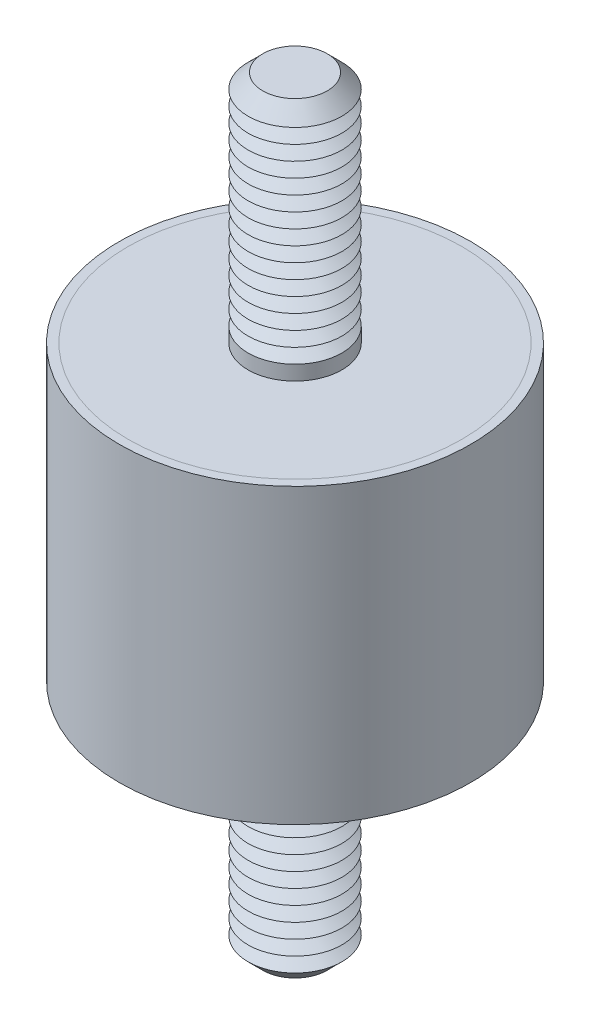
ISO-10303-21;
HEADER;
FILE_DESCRIPTION(('STEP AP214'),'2;1');
FILE_NAME('part.step','',(''),(''),'','','');
FILE_SCHEMA(('AUTOMOTIVE_DESIGN { 1 0 10303 214 1 1 1 1 }'));
ENDSEC;
DATA;
#1=APPLICATION_CONTEXT('core data for automotive mechanical design processes');
#2=APPLICATION_PROTOCOL_DEFINITION('international standard','automotive_design',2000,#1);
#3=PRODUCT_CONTEXT('',#1,'mechanical');
#4=PRODUCT('Part','Part','',(#3));
#5=PRODUCT_RELATED_PRODUCT_CATEGORY('part','',(#4));
#6=PRODUCT_DEFINITION_FORMATION('','',#4);
#7=PRODUCT_DEFINITION_CONTEXT('part definition',#1,'design');
#8=PRODUCT_DEFINITION('design','',#6,#7);
#9=PRODUCT_DEFINITION_SHAPE('','',#8);
#10=(LENGTH_UNIT() NAMED_UNIT(*) SI_UNIT(.MILLI.,.METRE.));
#11=(NAMED_UNIT(*) PLANE_ANGLE_UNIT() SI_UNIT($,.RADIAN.));
#12=(NAMED_UNIT(*) SI_UNIT($,.STERADIAN.) SOLID_ANGLE_UNIT());
#13=UNCERTAINTY_MEASURE_WITH_UNIT(LENGTH_MEASURE(1.E-05),#10,'distance_accuracy_value','');
#14=(GEOMETRIC_REPRESENTATION_CONTEXT(3) GLOBAL_UNCERTAINTY_ASSIGNED_CONTEXT((#13)) GLOBAL_UNIT_ASSIGNED_CONTEXT((#10,
#11,#12)) REPRESENTATION_CONTEXT('',''));
#15=CARTESIAN_POINT('',(0.,0.,0.));
#16=DIRECTION('',(0.,0.,1.));
#17=DIRECTION('',(1.,0.,0.));
#18=AXIS2_PLACEMENT_3D('',#15,#16,#17);
#19=CARTESIAN_POINT('',(0.,-32.5,0.));
#20=DIRECTION('',(0.,1.,0.));
#21=DIRECTION('',(0.,0.,1.));
#22=AXIS2_PLACEMENT_3D('',#19,#20,#21);
#23=CYLINDRICAL_SURFACE('',#22,4.);
#24=CARTESIAN_POINT('',(0.,-12.5,0.));
#25=DIRECTION('',(0.,-1.,0.));
#26=DIRECTION('',(0.,0.,-1.));
#27=AXIS2_PLACEMENT_3D('',#24,#25,#26);
#28=CIRCLE('',#27,4.);
#29=CARTESIAN_POINT('',(0.,-12.5,-4.));
#30=VERTEX_POINT('',#29);
#31=EDGE_CURVE('P0_E21',#30,#30,#28,.T.);
#32=ORIENTED_EDGE('',*,*,#31,.T.);
#33=EDGE_LOOP('',(#32));
#34=FACE_BOUND('',#33,.T.);
#35=CARTESIAN_POINT('',(0.,-13.75,0.));
#36=DIRECTION('',(0.,1.,0.));
#37=DIRECTION('',(0.,0.,1.));
#38=AXIS2_PLACEMENT_3D('',#35,#36,#37);
#39=CIRCLE('',#38,4.);
#40=CARTESIAN_POINT('',(0.,-13.75,4.));
#41=VERTEX_POINT('',#40);
#42=EDGE_CURVE('P0_E33',#41,#41,#39,.T.);
#43=ORIENTED_EDGE('',*,*,#42,.T.);
#44=EDGE_LOOP('',(#43));
#45=FACE_BOUND('',#44,.T.);
#46=ADVANCED_FACE('P0_F14',(#34,#45),#23,.T.);
#47=CARTESIAN_POINT('',(0.,-12.5,0.));
#48=DIRECTION('',(0.,1.,0.));
#49=DIRECTION('',(0.,0.,1.));
#50=AXIS2_PLACEMENT_3D('',#47,#48,#49);
#51=CYLINDRICAL_SURFACE('',#50,14.25);
#52=CARTESIAN_POINT('',(0.,-12.5,0.));
#53=DIRECTION('',(0.,1.,0.));
#54=DIRECTION('',(0.,0.,1.));
#55=AXIS2_PLACEMENT_3D('',#52,#53,#54);
#56=CIRCLE('',#55,14.25);
#57=CARTESIAN_POINT('',(0.,-12.5,14.25));
#58=VERTEX_POINT('',#57);
#59=EDGE_CURVE('P0_E25',#58,#58,#56,.T.);
#60=ORIENTED_EDGE('',*,*,#59,.T.);
#61=EDGE_LOOP('',(#60));
#62=FACE_BOUND('',#61,.T.);
#63=CARTESIAN_POINT('',(0.,-11.5,0.));
#64=DIRECTION('',(0.,1.,0.));
#65=DIRECTION('',(0.,0.,1.));
#66=AXIS2_PLACEMENT_3D('',#63,#64,#65);
#67=CIRCLE('',#66,14.25);
#68=CARTESIAN_POINT('',(0.,-11.5,14.25));
#69=VERTEX_POINT('',#68);
#70=EDGE_CURVE('P0_E30',#69,#69,#67,.T.);
#71=ORIENTED_EDGE('',*,*,#70,.F.);
#72=EDGE_LOOP('',(#71));
#73=FACE_BOUND('',#72,.T.);
#74=ADVANCED_FACE('P0_F145',(#62,#73),#51,.T.);
#75=CARTESIAN_POINT('',(0.,-12.5,0.));
#76=DIRECTION('',(0.,1.,0.));
#77=DIRECTION('',(0.,0.,1.));
#78=AXIS2_PLACEMENT_3D('',#75,#76,#77);
#79=PLANE('',#78);
#80=ORIENTED_EDGE('',*,*,#31,.F.);
#81=EDGE_LOOP('',(#80));
#82=FACE_BOUND('',#81,.T.);
#83=ORIENTED_EDGE('',*,*,#59,.F.);
#84=EDGE_LOOP('',(#83));
#85=FACE_BOUND('',#84,.T.);
#86=ADVANCED_FACE('P0_F150',(#82,#85),#79,.F.);
#87=CARTESIAN_POINT('',(0.,-11.5,0.));
#88=DIRECTION('',(0.,1.,0.));
#89=DIRECTION('',(0.,0.,1.));
#90=AXIS2_PLACEMENT_3D('',#87,#88,#89);
#91=PLANE('',#90);
#92=ORIENTED_EDGE('',*,*,#70,.T.);
#93=EDGE_LOOP('',(#92));
#94=FACE_BOUND('',#93,.T.);
#95=ADVANCED_FACE('P0_F156',(#94),#91,.T.);
#96=CARTESIAN_POINT('',(0.,-13.75,0.));
#97=DIRECTION('',(0.,1.,0.));
#98=DIRECTION('',(0.,0.,1.));
#99=AXIS2_PLACEMENT_3D('',#96,#97,#98);
#100=CONICAL_SURFACE('',#99,4.,1.0471975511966);
#101=CARTESIAN_POINT('',(0.,-14.375,0.));
#102=DIRECTION('',(0.,1.,0.));
#103=DIRECTION('',(0.,0.,1.));
#104=AXIS2_PLACEMENT_3D('',#101,#102,#103);
#105=CIRCLE('',#104,2.91746824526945);
#106=CARTESIAN_POINT('',(0.,-14.375,2.91746824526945));
#107=VERTEX_POINT('',#106);
#108=EDGE_CURVE('P0_E39',#107,#107,#105,.T.);
#109=ORIENTED_EDGE('',*,*,#108,.T.);
#110=EDGE_LOOP('',(#109));
#111=FACE_BOUND('',#110,.T.);
#112=ORIENTED_EDGE('',*,*,#42,.F.);
#113=EDGE_LOOP('',(#112));
#114=FACE_BOUND('',#113,.T.);
#115=ADVANCED_FACE('P0_F159',(#111,#114),#100,.T.);
#116=CARTESIAN_POINT('',(0.,-14.375,0.));
#117=DIRECTION('',(0.,-1.,0.));
#118=DIRECTION('',(0.,0.,-1.));
#119=AXIS2_PLACEMENT_3D('',#116,#117,#118);
#120=CONICAL_SURFACE('',#119,2.91746824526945,1.04719755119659);
#121=CARTESIAN_POINT('',(0.,-15.,0.));
#122=DIRECTION('',(0.,1.,0.));
#123=DIRECTION('',(0.,0.,1.));
#124=AXIS2_PLACEMENT_3D('',#121,#122,#123);
#125=CIRCLE('',#124,4.);
#126=CARTESIAN_POINT('',(0.,-15.,4.));
#127=VERTEX_POINT('',#126);
#128=EDGE_CURVE('P0_E43',#127,#127,#125,.T.);
#129=ORIENTED_EDGE('',*,*,#128,.T.);
#130=EDGE_LOOP('',(#129));
#131=FACE_BOUND('',#130,.T.);
#132=ORIENTED_EDGE('',*,*,#108,.F.);
#133=EDGE_LOOP('',(#132));
#134=FACE_BOUND('',#133,.T.);
#135=ADVANCED_FACE('P0_F163',(#131,#134),#120,.T.);
#136=CARTESIAN_POINT('',(0.,-15.,0.));
#137=DIRECTION('',(0.,1.,0.));
#138=DIRECTION('',(0.,0.,1.));
#139=AXIS2_PLACEMENT_3D('',#136,#137,#138);
#140=CONICAL_SURFACE('',#139,4.,1.0471975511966);
#141=CARTESIAN_POINT('',(0.,-15.625,0.));
#142=DIRECTION('',(0.,1.,0.));
#143=DIRECTION('',(0.,0.,1.));
#144=AXIS2_PLACEMENT_3D('',#141,#142,#143);
#145=CIRCLE('',#144,2.91746824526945);
#146=CARTESIAN_POINT('',(0.,-15.625,2.91746824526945));
#147=VERTEX_POINT('',#146);
#148=EDGE_CURVE('P0_E47',#147,#147,#145,.T.);
#149=ORIENTED_EDGE('',*,*,#148,.T.);
#150=EDGE_LOOP('',(#149));
#151=FACE_BOUND('',#150,.T.);
#152=ORIENTED_EDGE('',*,*,#128,.F.);
#153=EDGE_LOOP('',(#152));
#154=FACE_BOUND('',#153,.T.);
#155=ADVANCED_FACE('P0_F167',(#151,#154),#140,.T.);
#156=CARTESIAN_POINT('',(0.,-15.625,0.));
#157=DIRECTION('',(0.,-1.,0.));
#158=DIRECTION('',(0.,0.,-1.));
#159=AXIS2_PLACEMENT_3D('',#156,#157,#158);
#160=CONICAL_SURFACE('',#159,2.91746824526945,1.04719755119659);
#161=CARTESIAN_POINT('',(0.,-16.25,0.));
#162=DIRECTION('',(0.,1.,0.));
#163=DIRECTION('',(0.,0.,1.));
#164=AXIS2_PLACEMENT_3D('',#161,#162,#163);
#165=CIRCLE('',#164,4.);
#166=CARTESIAN_POINT('',(0.,-16.25,4.));
#167=VERTEX_POINT('',#166);
#168=EDGE_CURVE('P0_E52',#167,#167,#165,.T.);
#169=ORIENTED_EDGE('',*,*,#168,.T.);
#170=EDGE_LOOP('',(#169));
#171=FACE_BOUND('',#170,.T.);
#172=ORIENTED_EDGE('',*,*,#148,.F.);
#173=EDGE_LOOP('',(#172));
#174=FACE_BOUND('',#173,.T.);
#175=ADVANCED_FACE('P0_F174',(#171,#174),#160,.T.);
#176=CARTESIAN_POINT('',(0.,-16.25,0.));
#177=DIRECTION('',(0.,1.,0.));
#178=DIRECTION('',(0.,0.,1.));
#179=AXIS2_PLACEMENT_3D('',#176,#177,#178);
#180=CONICAL_SURFACE('',#179,4.,1.0471975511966);
#181=CARTESIAN_POINT('',(0.,-16.875,0.));
#182=DIRECTION('',(0.,1.,0.));
#183=DIRECTION('',(0.,0.,1.));
#184=AXIS2_PLACEMENT_3D('',#181,#182,#183);
#185=CIRCLE('',#184,2.91746824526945);
#186=CARTESIAN_POINT('',(0.,-16.875,2.91746824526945));
#187=VERTEX_POINT('',#186);
#188=EDGE_CURVE('P0_E55',#187,#187,#185,.T.);
#189=ORIENTED_EDGE('',*,*,#188,.T.);
#190=EDGE_LOOP('',(#189));
#191=FACE_BOUND('',#190,.T.);
#192=ORIENTED_EDGE('',*,*,#168,.F.);
#193=EDGE_LOOP('',(#192));
#194=FACE_BOUND('',#193,.T.);
#195=ADVANCED_FACE('P0_F178',(#191,#194),#180,.T.);
#196=CARTESIAN_POINT('',(0.,-16.875,0.));
#197=DIRECTION('',(0.,-1.,0.));
#198=DIRECTION('',(0.,0.,-1.));
#199=AXIS2_PLACEMENT_3D('',#196,#197,#198);
#200=CONICAL_SURFACE('',#199,2.91746824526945,1.04719755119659);
#201=CARTESIAN_POINT('',(0.,-17.5,0.));
#202=DIRECTION('',(0.,1.,0.));
#203=DIRECTION('',(0.,0.,1.));
#204=AXIS2_PLACEMENT_3D('',#201,#202,#203);
#205=CIRCLE('',#204,4.);
#206=CARTESIAN_POINT('',(0.,-17.5,4.));
#207=VERTEX_POINT('',#206);
#208=EDGE_CURVE('P0_E58',#207,#207,#205,.T.);
#209=ORIENTED_EDGE('',*,*,#208,.T.);
#210=EDGE_LOOP('',(#209));
#211=FACE_BOUND('',#210,.T.);
#212=ORIENTED_EDGE('',*,*,#188,.F.);
#213=EDGE_LOOP('',(#212));
#214=FACE_BOUND('',#213,.T.);
#215=ADVANCED_FACE('P0_F182',(#211,#214),#200,.T.);
#216=CARTESIAN_POINT('',(0.,-17.5,0.));
#217=DIRECTION('',(0.,1.,0.));
#218=DIRECTION('',(0.,0.,1.));
#219=AXIS2_PLACEMENT_3D('',#216,#217,#218);
#220=CONICAL_SURFACE('',#219,4.,1.0471975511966);
#221=CARTESIAN_POINT('',(0.,-18.125,0.));
#222=DIRECTION('',(0.,1.,0.));
#223=DIRECTION('',(0.,0.,1.));
#224=AXIS2_PLACEMENT_3D('',#221,#222,#223);
#225=CIRCLE('',#224,2.91746824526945);
#226=CARTESIAN_POINT('',(0.,-18.125,2.91746824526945));
#227=VERTEX_POINT('',#226);
#228=EDGE_CURVE('P0_E61',#227,#227,#225,.T.);
#229=ORIENTED_EDGE('',*,*,#228,.T.);
#230=EDGE_LOOP('',(#229));
#231=FACE_BOUND('',#230,.T.);
#232=ORIENTED_EDGE('',*,*,#208,.F.);
#233=EDGE_LOOP('',(#232));
#234=FACE_BOUND('',#233,.T.);
#235=ADVANCED_FACE('P0_F186',(#231,#234),#220,.T.);
#236=CARTESIAN_POINT('',(0.,-18.125,0.));
#237=DIRECTION('',(0.,-1.,0.));
#238=DIRECTION('',(0.,0.,-1.));
#239=AXIS2_PLACEMENT_3D('',#236,#237,#238);
#240=CONICAL_SURFACE('',#239,2.91746824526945,1.04719755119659);
#241=CARTESIAN_POINT('',(0.,-18.75,0.));
#242=DIRECTION('',(0.,1.,0.));
#243=DIRECTION('',(0.,0.,1.));
#244=AXIS2_PLACEMENT_3D('',#241,#242,#243);
#245=CIRCLE('',#244,4.);
#246=CARTESIAN_POINT('',(0.,-18.75,4.));
#247=VERTEX_POINT('',#246);
#248=EDGE_CURVE('P0_E64',#247,#247,#245,.T.);
#249=ORIENTED_EDGE('',*,*,#248,.T.);
#250=EDGE_LOOP('',(#249));
#251=FACE_BOUND('',#250,.T.);
#252=ORIENTED_EDGE('',*,*,#228,.F.);
#253=EDGE_LOOP('',(#252));
#254=FACE_BOUND('',#253,.T.);
#255=ADVANCED_FACE('P0_F190',(#251,#254),#240,.T.);
#256=CARTESIAN_POINT('',(0.,-18.75,0.));
#257=DIRECTION('',(0.,1.,0.));
#258=DIRECTION('',(0.,0.,1.));
#259=AXIS2_PLACEMENT_3D('',#256,#257,#258);
#260=CONICAL_SURFACE('',#259,4.,1.0471975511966);
#261=CARTESIAN_POINT('',(0.,-19.375,0.));
#262=DIRECTION('',(0.,1.,0.));
#263=DIRECTION('',(0.,0.,1.));
#264=AXIS2_PLACEMENT_3D('',#261,#262,#263);
#265=CIRCLE('',#264,2.91746824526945);
#266=CARTESIAN_POINT('',(0.,-19.375,2.91746824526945));
#267=VERTEX_POINT('',#266);
#268=EDGE_CURVE('P0_E67',#267,#267,#265,.T.);
#269=ORIENTED_EDGE('',*,*,#268,.T.);
#270=EDGE_LOOP('',(#269));
#271=FACE_BOUND('',#270,.T.);
#272=ORIENTED_EDGE('',*,*,#248,.F.);
#273=EDGE_LOOP('',(#272));
#274=FACE_BOUND('',#273,.T.);
#275=ADVANCED_FACE('P0_F194',(#271,#274),#260,.T.);
#276=CARTESIAN_POINT('',(0.,-19.375,0.));
#277=DIRECTION('',(0.,-1.,0.));
#278=DIRECTION('',(0.,0.,-1.));
#279=AXIS2_PLACEMENT_3D('',#276,#277,#278);
#280=CONICAL_SURFACE('',#279,2.91746824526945,1.04719755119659);
#281=CARTESIAN_POINT('',(0.,-20.,0.));
#282=DIRECTION('',(0.,1.,0.));
#283=DIRECTION('',(0.,0.,1.));
#284=AXIS2_PLACEMENT_3D('',#281,#282,#283);
#285=CIRCLE('',#284,4.);
#286=CARTESIAN_POINT('',(0.,-20.,4.));
#287=VERTEX_POINT('',#286);
#288=EDGE_CURVE('P0_E70',#287,#287,#285,.T.);
#289=ORIENTED_EDGE('',*,*,#288,.T.);
#290=EDGE_LOOP('',(#289));
#291=FACE_BOUND('',#290,.T.);
#292=ORIENTED_EDGE('',*,*,#268,.F.);
#293=EDGE_LOOP('',(#292));
#294=FACE_BOUND('',#293,.T.);
#295=ADVANCED_FACE('P0_F198',(#291,#294),#280,.T.);
#296=CARTESIAN_POINT('',(0.,-20.,0.));
#297=DIRECTION('',(0.,1.,0.));
#298=DIRECTION('',(0.,0.,1.));
#299=AXIS2_PLACEMENT_3D('',#296,#297,#298);
#300=CONICAL_SURFACE('',#299,4.,1.0471975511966);
#301=CARTESIAN_POINT('',(0.,-20.625,0.));
#302=DIRECTION('',(0.,1.,0.));
#303=DIRECTION('',(0.,0.,1.));
#304=AXIS2_PLACEMENT_3D('',#301,#302,#303);
#305=CIRCLE('',#304,2.91746824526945);
#306=CARTESIAN_POINT('',(0.,-20.625,2.91746824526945));
#307=VERTEX_POINT('',#306);
#308=EDGE_CURVE('P0_E73',#307,#307,#305,.T.);
#309=ORIENTED_EDGE('',*,*,#308,.T.);
#310=EDGE_LOOP('',(#309));
#311=FACE_BOUND('',#310,.T.);
#312=ORIENTED_EDGE('',*,*,#288,.F.);
#313=EDGE_LOOP('',(#312));
#314=FACE_BOUND('',#313,.T.);
#315=ADVANCED_FACE('P0_F202',(#311,#314),#300,.T.);
#316=CARTESIAN_POINT('',(0.,-20.625,0.));
#317=DIRECTION('',(0.,-1.,0.));
#318=DIRECTION('',(0.,0.,-1.));
#319=AXIS2_PLACEMENT_3D('',#316,#317,#318);
#320=CONICAL_SURFACE('',#319,2.91746824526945,1.04719755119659);
#321=CARTESIAN_POINT('',(0.,-21.25,0.));
#322=DIRECTION('',(0.,1.,0.));
#323=DIRECTION('',(0.,0.,1.));
#324=AXIS2_PLACEMENT_3D('',#321,#322,#323);
#325=CIRCLE('',#324,4.);
#326=CARTESIAN_POINT('',(0.,-21.25,4.));
#327=VERTEX_POINT('',#326);
#328=EDGE_CURVE('P0_E76',#327,#327,#325,.T.);
#329=ORIENTED_EDGE('',*,*,#328,.T.);
#330=EDGE_LOOP('',(#329));
#331=FACE_BOUND('',#330,.T.);
#332=ORIENTED_EDGE('',*,*,#308,.F.);
#333=EDGE_LOOP('',(#332));
#334=FACE_BOUND('',#333,.T.);
#335=ADVANCED_FACE('P0_F206',(#331,#334),#320,.T.);
#336=CARTESIAN_POINT('',(0.,-21.25,0.));
#337=DIRECTION('',(0.,1.,0.));
#338=DIRECTION('',(0.,0.,1.));
#339=AXIS2_PLACEMENT_3D('',#336,#337,#338);
#340=CONICAL_SURFACE('',#339,4.,1.0471975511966);
#341=CARTESIAN_POINT('',(0.,-21.875,0.));
#342=DIRECTION('',(0.,1.,0.));
#343=DIRECTION('',(0.,0.,1.));
#344=AXIS2_PLACEMENT_3D('',#341,#342,#343);
#345=CIRCLE('',#344,2.91746824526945);
#346=CARTESIAN_POINT('',(0.,-21.875,2.91746824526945));
#347=VERTEX_POINT('',#346);
#348=EDGE_CURVE('P0_E79',#347,#347,#345,.T.);
#349=ORIENTED_EDGE('',*,*,#348,.T.);
#350=EDGE_LOOP('',(#349));
#351=FACE_BOUND('',#350,.T.);
#352=ORIENTED_EDGE('',*,*,#328,.F.);
#353=EDGE_LOOP('',(#352));
#354=FACE_BOUND('',#353,.T.);
#355=ADVANCED_FACE('P0_F210',(#351,#354),#340,.T.);
#356=CARTESIAN_POINT('',(0.,-21.875,0.));
#357=DIRECTION('',(0.,-1.,0.));
#358=DIRECTION('',(0.,0.,-1.));
#359=AXIS2_PLACEMENT_3D('',#356,#357,#358);
#360=CONICAL_SURFACE('',#359,2.91746824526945,1.04719755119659);
#361=CARTESIAN_POINT('',(0.,-22.5,0.));
#362=DIRECTION('',(0.,1.,0.));
#363=DIRECTION('',(0.,0.,1.));
#364=AXIS2_PLACEMENT_3D('',#361,#362,#363);
#365=CIRCLE('',#364,4.);
#366=CARTESIAN_POINT('',(0.,-22.5,4.));
#367=VERTEX_POINT('',#366);
#368=EDGE_CURVE('P0_E82',#367,#367,#365,.T.);
#369=ORIENTED_EDGE('',*,*,#368,.T.);
#370=EDGE_LOOP('',(#369));
#371=FACE_BOUND('',#370,.T.);
#372=ORIENTED_EDGE('',*,*,#348,.F.);
#373=EDGE_LOOP('',(#372));
#374=FACE_BOUND('',#373,.T.);
#375=ADVANCED_FACE('P0_F214',(#371,#374),#360,.T.);
#376=CARTESIAN_POINT('',(0.,-22.5,0.));
#377=DIRECTION('',(0.,1.,0.));
#378=DIRECTION('',(0.,0.,1.));
#379=AXIS2_PLACEMENT_3D('',#376,#377,#378);
#380=CONICAL_SURFACE('',#379,4.,1.0471975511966);
#381=CARTESIAN_POINT('',(0.,-23.125,0.));
#382=DIRECTION('',(0.,1.,0.));
#383=DIRECTION('',(0.,0.,1.));
#384=AXIS2_PLACEMENT_3D('',#381,#382,#383);
#385=CIRCLE('',#384,2.91746824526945);
#386=CARTESIAN_POINT('',(0.,-23.125,2.91746824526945));
#387=VERTEX_POINT('',#386);
#388=EDGE_CURVE('P0_E85',#387,#387,#385,.T.);
#389=ORIENTED_EDGE('',*,*,#388,.T.);
#390=EDGE_LOOP('',(#389));
#391=FACE_BOUND('',#390,.T.);
#392=ORIENTED_EDGE('',*,*,#368,.F.);
#393=EDGE_LOOP('',(#392));
#394=FACE_BOUND('',#393,.T.);
#395=ADVANCED_FACE('P0_F218',(#391,#394),#380,.T.);
#396=CARTESIAN_POINT('',(0.,-23.125,0.));
#397=DIRECTION('',(0.,-1.,0.));
#398=DIRECTION('',(0.,0.,-1.));
#399=AXIS2_PLACEMENT_3D('',#396,#397,#398);
#400=CONICAL_SURFACE('',#399,2.91746824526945,1.04719755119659);
#401=CARTESIAN_POINT('',(0.,-23.75,0.));
#402=DIRECTION('',(0.,1.,0.));
#403=DIRECTION('',(0.,0.,1.));
#404=AXIS2_PLACEMENT_3D('',#401,#402,#403);
#405=CIRCLE('',#404,4.);
#406=CARTESIAN_POINT('',(0.,-23.75,4.));
#407=VERTEX_POINT('',#406);
#408=EDGE_CURVE('P0_E88',#407,#407,#405,.T.);
#409=ORIENTED_EDGE('',*,*,#408,.T.);
#410=EDGE_LOOP('',(#409));
#411=FACE_BOUND('',#410,.T.);
#412=ORIENTED_EDGE('',*,*,#388,.F.);
#413=EDGE_LOOP('',(#412));
#414=FACE_BOUND('',#413,.T.);
#415=ADVANCED_FACE('P0_F222',(#411,#414),#400,.T.);
#416=CARTESIAN_POINT('',(0.,-23.75,0.));
#417=DIRECTION('',(0.,1.,0.));
#418=DIRECTION('',(0.,0.,1.));
#419=AXIS2_PLACEMENT_3D('',#416,#417,#418);
#420=CONICAL_SURFACE('',#419,4.,1.0471975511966);
#421=CARTESIAN_POINT('',(0.,-24.375,0.));
#422=DIRECTION('',(0.,1.,0.));
#423=DIRECTION('',(0.,0.,1.));
#424=AXIS2_PLACEMENT_3D('',#421,#422,#423);
#425=CIRCLE('',#424,2.91746824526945);
#426=CARTESIAN_POINT('',(0.,-24.375,2.91746824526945));
#427=VERTEX_POINT('',#426);
#428=EDGE_CURVE('P0_E91',#427,#427,#425,.T.);
#429=ORIENTED_EDGE('',*,*,#428,.T.);
#430=EDGE_LOOP('',(#429));
#431=FACE_BOUND('',#430,.T.);
#432=ORIENTED_EDGE('',*,*,#408,.F.);
#433=EDGE_LOOP('',(#432));
#434=FACE_BOUND('',#433,.T.);
#435=ADVANCED_FACE('P0_F226',(#431,#434),#420,.T.);
#436=CARTESIAN_POINT('',(0.,-24.375,0.));
#437=DIRECTION('',(0.,-1.,0.));
#438=DIRECTION('',(0.,0.,-1.));
#439=AXIS2_PLACEMENT_3D('',#436,#437,#438);
#440=CONICAL_SURFACE('',#439,2.91746824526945,1.04719755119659);
#441=CARTESIAN_POINT('',(0.,-25.,0.));
#442=DIRECTION('',(0.,1.,0.));
#443=DIRECTION('',(0.,0.,1.));
#444=AXIS2_PLACEMENT_3D('',#441,#442,#443);
#445=CIRCLE('',#444,4.);
#446=CARTESIAN_POINT('',(0.,-25.,4.));
#447=VERTEX_POINT('',#446);
#448=EDGE_CURVE('P0_E94',#447,#447,#445,.T.);
#449=ORIENTED_EDGE('',*,*,#448,.T.);
#450=EDGE_LOOP('',(#449));
#451=FACE_BOUND('',#450,.T.);
#452=ORIENTED_EDGE('',*,*,#428,.F.);
#453=EDGE_LOOP('',(#452));
#454=FACE_BOUND('',#453,.T.);
#455=ADVANCED_FACE('P0_F230',(#451,#454),#440,.T.);
#456=CARTESIAN_POINT('',(0.,-25.,0.));
#457=DIRECTION('',(0.,1.,0.));
#458=DIRECTION('',(0.,0.,1.));
#459=AXIS2_PLACEMENT_3D('',#456,#457,#458);
#460=CONICAL_SURFACE('',#459,4.,1.0471975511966);
#461=CARTESIAN_POINT('',(0.,-25.625,0.));
#462=DIRECTION('',(0.,1.,0.));
#463=DIRECTION('',(0.,0.,1.));
#464=AXIS2_PLACEMENT_3D('',#461,#462,#463);
#465=CIRCLE('',#464,2.91746824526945);
#466=CARTESIAN_POINT('',(0.,-25.625,2.91746824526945));
#467=VERTEX_POINT('',#466);
#468=EDGE_CURVE('P0_E97',#467,#467,#465,.T.);
#469=ORIENTED_EDGE('',*,*,#468,.T.);
#470=EDGE_LOOP('',(#469));
#471=FACE_BOUND('',#470,.T.);
#472=ORIENTED_EDGE('',*,*,#448,.F.);
#473=EDGE_LOOP('',(#472));
#474=FACE_BOUND('',#473,.T.);
#475=ADVANCED_FACE('P0_F234',(#471,#474),#460,.T.);
#476=CARTESIAN_POINT('',(0.,-25.625,0.));
#477=DIRECTION('',(0.,-1.,0.));
#478=DIRECTION('',(0.,0.,-1.));
#479=AXIS2_PLACEMENT_3D('',#476,#477,#478);
#480=CONICAL_SURFACE('',#479,2.91746824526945,1.04719755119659);
#481=CARTESIAN_POINT('',(0.,-26.25,0.));
#482=DIRECTION('',(0.,1.,0.));
#483=DIRECTION('',(0.,0.,1.));
#484=AXIS2_PLACEMENT_3D('',#481,#482,#483);
#485=CIRCLE('',#484,4.);
#486=CARTESIAN_POINT('',(0.,-26.25,4.));
#487=VERTEX_POINT('',#486);
#488=EDGE_CURVE('P0_E100',#487,#487,#485,.T.);
#489=ORIENTED_EDGE('',*,*,#488,.T.);
#490=EDGE_LOOP('',(#489));
#491=FACE_BOUND('',#490,.T.);
#492=ORIENTED_EDGE('',*,*,#468,.F.);
#493=EDGE_LOOP('',(#492));
#494=FACE_BOUND('',#493,.T.);
#495=ADVANCED_FACE('P0_F238',(#491,#494),#480,.T.);
#496=CARTESIAN_POINT('',(0.,-26.25,0.));
#497=DIRECTION('',(0.,1.,0.));
#498=DIRECTION('',(0.,0.,1.));
#499=AXIS2_PLACEMENT_3D('',#496,#497,#498);
#500=CONICAL_SURFACE('',#499,4.,1.0471975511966);
#501=CARTESIAN_POINT('',(0.,-26.875,0.));
#502=DIRECTION('',(0.,1.,0.));
#503=DIRECTION('',(0.,0.,1.));
#504=AXIS2_PLACEMENT_3D('',#501,#502,#503);
#505=CIRCLE('',#504,2.91746824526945);
#506=CARTESIAN_POINT('',(0.,-26.875,2.91746824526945));
#507=VERTEX_POINT('',#506);
#508=EDGE_CURVE('P0_E103',#507,#507,#505,.T.);
#509=ORIENTED_EDGE('',*,*,#508,.T.);
#510=EDGE_LOOP('',(#509));
#511=FACE_BOUND('',#510,.T.);
#512=ORIENTED_EDGE('',*,*,#488,.F.);
#513=EDGE_LOOP('',(#512));
#514=FACE_BOUND('',#513,.T.);
#515=ADVANCED_FACE('P0_F242',(#511,#514),#500,.T.);
#516=CARTESIAN_POINT('',(0.,-26.875,0.));
#517=DIRECTION('',(0.,-1.,0.));
#518=DIRECTION('',(0.,0.,-1.));
#519=AXIS2_PLACEMENT_3D('',#516,#517,#518);
#520=CONICAL_SURFACE('',#519,2.91746824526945,1.04719755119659);
#521=CARTESIAN_POINT('',(0.,-27.5,0.));
#522=DIRECTION('',(0.,1.,0.));
#523=DIRECTION('',(0.,0.,1.));
#524=AXIS2_PLACEMENT_3D('',#521,#522,#523);
#525=CIRCLE('',#524,4.);
#526=CARTESIAN_POINT('',(0.,-27.5,4.));
#527=VERTEX_POINT('',#526);
#528=EDGE_CURVE('P0_E106',#527,#527,#525,.T.);
#529=ORIENTED_EDGE('',*,*,#528,.T.);
#530=EDGE_LOOP('',(#529));
#531=FACE_BOUND('',#530,.T.);
#532=ORIENTED_EDGE('',*,*,#508,.F.);
#533=EDGE_LOOP('',(#532));
#534=FACE_BOUND('',#533,.T.);
#535=ADVANCED_FACE('P0_F246',(#531,#534),#520,.T.);
#536=CARTESIAN_POINT('',(0.,-27.5,0.));
#537=DIRECTION('',(0.,1.,0.));
#538=DIRECTION('',(0.,0.,1.));
#539=AXIS2_PLACEMENT_3D('',#536,#537,#538);
#540=CONICAL_SURFACE('',#539,4.,1.0471975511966);
#541=CARTESIAN_POINT('',(0.,-28.125,0.));
#542=DIRECTION('',(0.,1.,0.));
#543=DIRECTION('',(0.,0.,1.));
#544=AXIS2_PLACEMENT_3D('',#541,#542,#543);
#545=CIRCLE('',#544,2.91746824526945);
#546=CARTESIAN_POINT('',(0.,-28.125,2.91746824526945));
#547=VERTEX_POINT('',#546);
#548=EDGE_CURVE('P0_E109',#547,#547,#545,.T.);
#549=ORIENTED_EDGE('',*,*,#548,.T.);
#550=EDGE_LOOP('',(#549));
#551=FACE_BOUND('',#550,.T.);
#552=ORIENTED_EDGE('',*,*,#528,.F.);
#553=EDGE_LOOP('',(#552));
#554=FACE_BOUND('',#553,.T.);
#555=ADVANCED_FACE('P0_F250',(#551,#554),#540,.T.);
#556=CARTESIAN_POINT('',(0.,-28.125,0.));
#557=DIRECTION('',(0.,-1.,0.));
#558=DIRECTION('',(0.,0.,-1.));
#559=AXIS2_PLACEMENT_3D('',#556,#557,#558);
#560=CONICAL_SURFACE('',#559,2.91746824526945,1.04719755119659);
#561=CARTESIAN_POINT('',(0.,-28.75,0.));
#562=DIRECTION('',(0.,1.,0.));
#563=DIRECTION('',(0.,0.,1.));
#564=AXIS2_PLACEMENT_3D('',#561,#562,#563);
#565=CIRCLE('',#564,4.);
#566=CARTESIAN_POINT('',(0.,-28.75,4.));
#567=VERTEX_POINT('',#566);
#568=EDGE_CURVE('P0_E112',#567,#567,#565,.T.);
#569=ORIENTED_EDGE('',*,*,#568,.T.);
#570=EDGE_LOOP('',(#569));
#571=FACE_BOUND('',#570,.T.);
#572=ORIENTED_EDGE('',*,*,#548,.F.);
#573=EDGE_LOOP('',(#572));
#574=FACE_BOUND('',#573,.T.);
#575=ADVANCED_FACE('P0_F254',(#571,#574),#560,.T.);
#576=CARTESIAN_POINT('',(0.,-28.75,0.));
#577=DIRECTION('',(0.,1.,0.));
#578=DIRECTION('',(0.,0.,1.));
#579=AXIS2_PLACEMENT_3D('',#576,#577,#578);
#580=CONICAL_SURFACE('',#579,4.,1.0471975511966);
#581=CARTESIAN_POINT('',(0.,-29.375,0.));
#582=DIRECTION('',(0.,1.,0.));
#583=DIRECTION('',(0.,0.,1.));
#584=AXIS2_PLACEMENT_3D('',#581,#582,#583);
#585=CIRCLE('',#584,2.91746824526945);
#586=CARTESIAN_POINT('',(0.,-29.375,2.91746824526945));
#587=VERTEX_POINT('',#586);
#588=EDGE_CURVE('P0_E115',#587,#587,#585,.T.);
#589=ORIENTED_EDGE('',*,*,#588,.T.);
#590=EDGE_LOOP('',(#589));
#591=FACE_BOUND('',#590,.T.);
#592=ORIENTED_EDGE('',*,*,#568,.F.);
#593=EDGE_LOOP('',(#592));
#594=FACE_BOUND('',#593,.T.);
#595=ADVANCED_FACE('P0_F258',(#591,#594),#580,.T.);
#596=CARTESIAN_POINT('',(0.,-29.375,0.));
#597=DIRECTION('',(0.,-1.,0.));
#598=DIRECTION('',(0.,0.,-1.));
#599=AXIS2_PLACEMENT_3D('',#596,#597,#598);
#600=CONICAL_SURFACE('',#599,2.91746824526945,1.04719755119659);
#601=CARTESIAN_POINT('',(0.,-30.,0.));
#602=DIRECTION('',(0.,1.,0.));
#603=DIRECTION('',(0.,0.,1.));
#604=AXIS2_PLACEMENT_3D('',#601,#602,#603);
#605=CIRCLE('',#604,4.);
#606=CARTESIAN_POINT('',(0.,-30.,4.));
#607=VERTEX_POINT('',#606);
#608=EDGE_CURVE('P0_E118',#607,#607,#605,.T.);
#609=ORIENTED_EDGE('',*,*,#608,.T.);
#610=EDGE_LOOP('',(#609));
#611=FACE_BOUND('',#610,.T.);
#612=ORIENTED_EDGE('',*,*,#588,.F.);
#613=EDGE_LOOP('',(#612));
#614=FACE_BOUND('',#613,.T.);
#615=ADVANCED_FACE('P0_F142',(#611,#614),#600,.T.);
#616=CARTESIAN_POINT('',(0.,-30.,0.));
#617=DIRECTION('',(0.,1.,0.));
#618=DIRECTION('',(0.,0.,1.));
#619=AXIS2_PLACEMENT_3D('',#616,#617,#618);
#620=CONICAL_SURFACE('',#619,4.,1.0471975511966);
#621=CARTESIAN_POINT('',(0.,-30.625,0.));
#622=DIRECTION('',(0.,1.,0.));
#623=DIRECTION('',(0.,0.,1.));
#624=AXIS2_PLACEMENT_3D('',#621,#622,#623);
#625=CIRCLE('',#624,2.91746824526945);
#626=CARTESIAN_POINT('',(0.,-30.625,2.91746824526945));
#627=VERTEX_POINT('',#626);
#628=EDGE_CURVE('P0_E124',#627,#627,#625,.T.);
#629=ORIENTED_EDGE('',*,*,#628,.T.);
#630=EDGE_LOOP('',(#629));
#631=FACE_BOUND('',#630,.T.);
#632=ORIENTED_EDGE('',*,*,#608,.F.);
#633=EDGE_LOOP('',(#632));
#634=FACE_BOUND('',#633,.T.);
#635=ADVANCED_FACE('P0_F128',(#631,#634),#620,.T.);
#636=CARTESIAN_POINT('',(0.,-30.625,0.));
#637=DIRECTION('',(0.,-1.,0.));
#638=DIRECTION('',(0.,0.,-1.));
#639=AXIS2_PLACEMENT_3D('',#636,#637,#638);
#640=CONICAL_SURFACE('',#639,2.91746824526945,1.04719755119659);
#641=CARTESIAN_POINT('',(0.,-31.25,0.));
#642=DIRECTION('',(0.,1.,0.));
#643=DIRECTION('',(0.,0.,1.));
#644=AXIS2_PLACEMENT_3D('',#641,#642,#643);
#645=CIRCLE('',#644,4.);
#646=CARTESIAN_POINT('',(0.,-31.25,4.));
#647=VERTEX_POINT('',#646);
#648=EDGE_CURVE('P0_E121',#647,#647,#645,.T.);
#649=ORIENTED_EDGE('',*,*,#648,.T.);
#650=EDGE_LOOP('',(#649));
#651=FACE_BOUND('',#650,.T.);
#652=ORIENTED_EDGE('',*,*,#628,.F.);
#653=EDGE_LOOP('',(#652));
#654=FACE_BOUND('',#653,.T.);
#655=ADVANCED_FACE('P0_F131',(#651,#654),#640,.T.);
#656=CARTESIAN_POINT('',(0.,-32.5,0.));
#657=DIRECTION('',(0.,-1.,0.));
#658=DIRECTION('',(0.,0.,-1.));
#659=AXIS2_PLACEMENT_3D('',#656,#657,#658);
#660=PLANE('',#659);
#661=CARTESIAN_POINT('',(0.,-32.5,0.));
#662=DIRECTION('',(0.,-1.,0.));
#663=DIRECTION('',(0.,0.,-1.));
#664=AXIS2_PLACEMENT_3D('',#661,#662,#663);
#665=CIRCLE('',#664,2.75000000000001);
#666=CARTESIAN_POINT('',(0.,-32.5,-2.75000000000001));
#667=VERTEX_POINT('',#666);
#668=EDGE_CURVE('P0_E10',#667,#667,#665,.T.);
#669=ORIENTED_EDGE('',*,*,#668,.T.);
#670=EDGE_LOOP('',(#669));
#671=FACE_BOUND('',#670,.T.);
#672=ADVANCED_FACE('P0_F133',(#671),#660,.T.);
#673=CARTESIAN_POINT('',(0.,-32.5,0.));
#674=DIRECTION('',(0.,1.,0.));
#675=DIRECTION('',(0.,0.,1.));
#676=AXIS2_PLACEMENT_3D('',#673,#674,#675);
#677=CONICAL_SURFACE('',#676,2.75000000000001,0.785398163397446);
#678=ORIENTED_EDGE('',*,*,#648,.F.);
#679=EDGE_LOOP('',(#678));
#680=FACE_BOUND('',#679,.T.);
#681=ORIENTED_EDGE('',*,*,#668,.F.);
#682=EDGE_LOOP('',(#681));
#683=FACE_BOUND('',#682,.T.);
#684=ADVANCED_FACE('P0_F16',(#680,#683),#677,.T.);
#685=CLOSED_SHELL('',(#46,#74,#86,#95,#115,#135,#155,#175,#195,#215,#235,#255,#275,#295,#315,
#335,#355,#375,#395,#415,#435,#455,#475,#495,#515,#535,#555,#575,#595,#615,#635,#655,#672,#684));
#686=MANIFOLD_SOLID_BREP('P0_B1',#685);
#687=CARTESIAN_POINT('',(0.,32.5,0.));
#688=DIRECTION('',(0.,-1.,0.));
#689=DIRECTION('',(0.,0.,-1.));
#690=AXIS2_PLACEMENT_3D('',#687,#688,#689);
#691=CYLINDRICAL_SURFACE('',#690,4.);
#692=CARTESIAN_POINT('',(0.,13.75,0.));
#693=DIRECTION('',(0.,1.,0.));
#694=DIRECTION('',(0.,0.,1.));
#695=AXIS2_PLACEMENT_3D('',#692,#693,#694);
#696=CIRCLE('',#695,4.);
#697=CARTESIAN_POINT('',(0.,13.75,4.));
#698=VERTEX_POINT('',#697);
#699=EDGE_CURVE('P1_E33',#698,#698,#696,.T.);
#700=ORIENTED_EDGE('',*,*,#699,.F.);
#701=EDGE_LOOP('',(#700));
#702=FACE_BOUND('',#701,.T.);
#703=CARTESIAN_POINT('',(0.,12.5,0.));
#704=DIRECTION('',(0.,1.,0.));
#705=DIRECTION('',(0.,0.,1.));
#706=AXIS2_PLACEMENT_3D('',#703,#704,#705);
#707=CIRCLE('',#706,4.);
#708=CARTESIAN_POINT('',(0.,12.5,4.));
#709=VERTEX_POINT('',#708);
#710=EDGE_CURVE('P1_E21',#709,#709,#707,.T.);
#711=ORIENTED_EDGE('',*,*,#710,.T.);
#712=EDGE_LOOP('',(#711));
#713=FACE_BOUND('',#712,.T.);
#714=ADVANCED_FACE('P1_F14',(#702,#713),#691,.T.);
#715=CARTESIAN_POINT('',(0.,12.5,0.));
#716=DIRECTION('',(0.,-1.,0.));
#717=DIRECTION('',(0.,0.,-1.));
#718=AXIS2_PLACEMENT_3D('',#715,#716,#717);
#719=CYLINDRICAL_SURFACE('',#718,14.25);
#720=CARTESIAN_POINT('',(0.,12.5,0.));
#721=DIRECTION('',(0.,1.,0.));
#722=DIRECTION('',(0.,0.,1.));
#723=AXIS2_PLACEMENT_3D('',#720,#721,#722);
#724=CIRCLE('',#723,14.25);
#725=CARTESIAN_POINT('',(0.,12.5,14.25));
#726=VERTEX_POINT('',#725);
#727=EDGE_CURVE('P1_E25',#726,#726,#724,.T.);
#728=ORIENTED_EDGE('',*,*,#727,.F.);
#729=EDGE_LOOP('',(#728));
#730=FACE_BOUND('',#729,.T.);
#731=CARTESIAN_POINT('',(0.,11.5,0.));
#732=DIRECTION('',(0.,1.,0.));
#733=DIRECTION('',(0.,0.,1.));
#734=AXIS2_PLACEMENT_3D('',#731,#732,#733);
#735=CIRCLE('',#734,14.25);
#736=CARTESIAN_POINT('',(0.,11.5,14.25));
#737=VERTEX_POINT('',#736);
#738=EDGE_CURVE('P1_E30',#737,#737,#735,.T.);
#739=ORIENTED_EDGE('',*,*,#738,.T.);
#740=EDGE_LOOP('',(#739));
#741=FACE_BOUND('',#740,.T.);
#742=ADVANCED_FACE('P1_F292',(#730,#741),#719,.T.);
#743=CARTESIAN_POINT('',(0.,12.5,0.));
#744=DIRECTION('',(0.,1.,0.));
#745=DIRECTION('',(0.,0.,1.));
#746=AXIS2_PLACEMENT_3D('',#743,#744,#745);
#747=PLANE('',#746);
#748=ORIENTED_EDGE('',*,*,#710,.F.);
#749=EDGE_LOOP('',(#748));
#750=FACE_BOUND('',#749,.T.);
#751=ORIENTED_EDGE('',*,*,#727,.T.);
#752=EDGE_LOOP('',(#751));
#753=FACE_BOUND('',#752,.T.);
#754=ADVANCED_FACE('P1_F298',(#750,#753),#747,.T.);
#755=CARTESIAN_POINT('',(0.,11.5,0.));
#756=DIRECTION('',(0.,1.,0.));
#757=DIRECTION('',(0.,0.,1.));
#758=AXIS2_PLACEMENT_3D('',#755,#756,#757);
#759=PLANE('',#758);
#760=ORIENTED_EDGE('',*,*,#738,.F.);
#761=EDGE_LOOP('',(#760));
#762=FACE_BOUND('',#761,.T.);
#763=ADVANCED_FACE('P1_F288',(#762),#759,.F.);
#764=CARTESIAN_POINT('',(0.,13.75,0.));
#765=DIRECTION('',(0.,-1.,0.));
#766=DIRECTION('',(0.,0.,-1.));
#767=AXIS2_PLACEMENT_3D('',#764,#765,#766);
#768=CONICAL_SURFACE('',#767,4.,1.0471975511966);
#769=CARTESIAN_POINT('',(0.,14.375,0.));
#770=DIRECTION('',(0.,1.,0.));
#771=DIRECTION('',(0.,0.,1.));
#772=AXIS2_PLACEMENT_3D('',#769,#770,#771);
#773=CIRCLE('',#772,2.91746824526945);
#774=CARTESIAN_POINT('',(0.,14.375,2.91746824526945));
#775=VERTEX_POINT('',#774);
#776=EDGE_CURVE('P1_E39',#775,#775,#773,.T.);
#777=ORIENTED_EDGE('',*,*,#776,.F.);
#778=EDGE_LOOP('',(#777));
#779=FACE_BOUND('',#778,.T.);
#780=ORIENTED_EDGE('',*,*,#699,.T.);
#781=EDGE_LOOP('',(#780));
#782=FACE_BOUND('',#781,.T.);
#783=ADVANCED_FACE('P1_F282',(#779,#782),#768,.T.);
#784=CARTESIAN_POINT('',(0.,14.375,0.));
#785=DIRECTION('',(0.,1.,0.));
#786=DIRECTION('',(0.,0.,1.));
#787=AXIS2_PLACEMENT_3D('',#784,#785,#786);
#788=CONICAL_SURFACE('',#787,2.91746824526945,1.04719755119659);
#789=CARTESIAN_POINT('',(0.,15.,0.));
#790=DIRECTION('',(0.,1.,0.));
#791=DIRECTION('',(0.,0.,1.));
#792=AXIS2_PLACEMENT_3D('',#789,#790,#791);
#793=CIRCLE('',#792,4.);
#794=CARTESIAN_POINT('',(0.,15.,4.));
#795=VERTEX_POINT('',#794);
#796=EDGE_CURVE('P1_E43',#795,#795,#793,.T.);
#797=ORIENTED_EDGE('',*,*,#796,.F.);
#798=EDGE_LOOP('',(#797));
#799=FACE_BOUND('',#798,.T.);
#800=ORIENTED_EDGE('',*,*,#776,.T.);
#801=EDGE_LOOP('',(#800));
#802=FACE_BOUND('',#801,.T.);
#803=ADVANCED_FACE('P1_F277',(#799,#802),#788,.T.);
#804=CARTESIAN_POINT('',(0.,15.,0.));
#805=DIRECTION('',(0.,-1.,0.));
#806=DIRECTION('',(0.,0.,-1.));
#807=AXIS2_PLACEMENT_3D('',#804,#805,#806);
#808=CONICAL_SURFACE('',#807,4.,1.0471975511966);
#809=CARTESIAN_POINT('',(0.,15.625,0.));
#810=DIRECTION('',(0.,1.,0.));
#811=DIRECTION('',(0.,0.,1.));
#812=AXIS2_PLACEMENT_3D('',#809,#810,#811);
#813=CIRCLE('',#812,2.91746824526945);
#814=CARTESIAN_POINT('',(0.,15.625,2.91746824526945));
#815=VERTEX_POINT('',#814);
#816=EDGE_CURVE('P1_E47',#815,#815,#813,.T.);
#817=ORIENTED_EDGE('',*,*,#816,.F.);
#818=EDGE_LOOP('',(#817));
#819=FACE_BOUND('',#818,.T.);
#820=ORIENTED_EDGE('',*,*,#796,.T.);
#821=EDGE_LOOP('',(#820));
#822=FACE_BOUND('',#821,.T.);
#823=ADVANCED_FACE('P1_F271',(#819,#822),#808,.T.);
#824=CARTESIAN_POINT('',(0.,15.625,0.));
#825=DIRECTION('',(0.,1.,0.));
#826=DIRECTION('',(0.,0.,1.));
#827=AXIS2_PLACEMENT_3D('',#824,#825,#826);
#828=CONICAL_SURFACE('',#827,2.91746824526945,1.04719755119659);
#829=CARTESIAN_POINT('',(0.,16.25,0.));
#830=DIRECTION('',(0.,1.,0.));
#831=DIRECTION('',(0.,0.,1.));
#832=AXIS2_PLACEMENT_3D('',#829,#830,#831);
#833=CIRCLE('',#832,4.);
#834=CARTESIAN_POINT('',(0.,16.25,4.));
#835=VERTEX_POINT('',#834);
#836=EDGE_CURVE('P1_E52',#835,#835,#833,.T.);
#837=ORIENTED_EDGE('',*,*,#836,.F.);
#838=EDGE_LOOP('',(#837));
#839=FACE_BOUND('',#838,.T.);
#840=ORIENTED_EDGE('',*,*,#816,.T.);
#841=EDGE_LOOP('',(#840));
#842=FACE_BOUND('',#841,.T.);
#843=ADVANCED_FACE('P1_F265',(#839,#842),#828,.T.);
#844=CARTESIAN_POINT('',(0.,16.25,0.));
#845=DIRECTION('',(0.,-1.,0.));
#846=DIRECTION('',(0.,0.,-1.));
#847=AXIS2_PLACEMENT_3D('',#844,#845,#846);
#848=CONICAL_SURFACE('',#847,4.,1.0471975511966);
#849=CARTESIAN_POINT('',(0.,16.875,0.));
#850=DIRECTION('',(0.,1.,0.));
#851=DIRECTION('',(0.,0.,1.));
#852=AXIS2_PLACEMENT_3D('',#849,#850,#851);
#853=CIRCLE('',#852,2.91746824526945);
#854=CARTESIAN_POINT('',(0.,16.875,2.91746824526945));
#855=VERTEX_POINT('',#854);
#856=EDGE_CURVE('P1_E55',#855,#855,#853,.T.);
#857=ORIENTED_EDGE('',*,*,#856,.F.);
#858=EDGE_LOOP('',(#857));
#859=FACE_BOUND('',#858,.T.);
#860=ORIENTED_EDGE('',*,*,#836,.T.);
#861=EDGE_LOOP('',(#860));
#862=FACE_BOUND('',#861,.T.);
#863=ADVANCED_FACE('P1_F259',(#859,#862),#848,.T.);
#864=CARTESIAN_POINT('',(0.,16.875,0.));
#865=DIRECTION('',(0.,1.,0.));
#866=DIRECTION('',(0.,0.,1.));
#867=AXIS2_PLACEMENT_3D('',#864,#865,#866);
#868=CONICAL_SURFACE('',#867,2.91746824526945,1.04719755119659);
#869=CARTESIAN_POINT('',(0.,17.5,0.));
#870=DIRECTION('',(0.,1.,0.));
#871=DIRECTION('',(0.,0.,1.));
#872=AXIS2_PLACEMENT_3D('',#869,#870,#871);
#873=CIRCLE('',#872,4.);
#874=CARTESIAN_POINT('',(0.,17.5,4.));
#875=VERTEX_POINT('',#874);
#876=EDGE_CURVE('P1_E58',#875,#875,#873,.T.);
#877=ORIENTED_EDGE('',*,*,#876,.F.);
#878=EDGE_LOOP('',(#877));
#879=FACE_BOUND('',#878,.T.);
#880=ORIENTED_EDGE('',*,*,#856,.T.);
#881=EDGE_LOOP('',(#880));
#882=FACE_BOUND('',#881,.T.);
#883=ADVANCED_FACE('P1_F253',(#879,#882),#868,.T.);
#884=CARTESIAN_POINT('',(0.,17.5,0.));
#885=DIRECTION('',(0.,-1.,0.));
#886=DIRECTION('',(0.,0.,-1.));
#887=AXIS2_PLACEMENT_3D('',#884,#885,#886);
#888=CONICAL_SURFACE('',#887,4.,1.0471975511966);
#889=CARTESIAN_POINT('',(0.,18.125,0.));
#890=DIRECTION('',(0.,1.,0.));
#891=DIRECTION('',(0.,0.,1.));
#892=AXIS2_PLACEMENT_3D('',#889,#890,#891);
#893=CIRCLE('',#892,2.91746824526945);
#894=CARTESIAN_POINT('',(0.,18.125,2.91746824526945));
#895=VERTEX_POINT('',#894);
#896=EDGE_CURVE('P1_E61',#895,#895,#893,.T.);
#897=ORIENTED_EDGE('',*,*,#896,.F.);
#898=EDGE_LOOP('',(#897));
#899=FACE_BOUND('',#898,.T.);
#900=ORIENTED_EDGE('',*,*,#876,.T.);
#901=EDGE_LOOP('',(#900));
#902=FACE_BOUND('',#901,.T.);
#903=ADVANCED_FACE('P1_F247',(#899,#902),#888,.T.);
#904=CARTESIAN_POINT('',(0.,18.125,0.));
#905=DIRECTION('',(0.,1.,0.));
#906=DIRECTION('',(0.,0.,1.));
#907=AXIS2_PLACEMENT_3D('',#904,#905,#906);
#908=CONICAL_SURFACE('',#907,2.91746824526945,1.04719755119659);
#909=CARTESIAN_POINT('',(0.,18.75,0.));
#910=DIRECTION('',(0.,1.,0.));
#911=DIRECTION('',(0.,0.,1.));
#912=AXIS2_PLACEMENT_3D('',#909,#910,#911);
#913=CIRCLE('',#912,4.);
#914=CARTESIAN_POINT('',(0.,18.75,4.));
#915=VERTEX_POINT('',#914);
#916=EDGE_CURVE('P1_E64',#915,#915,#913,.T.);
#917=ORIENTED_EDGE('',*,*,#916,.F.);
#918=EDGE_LOOP('',(#917));
#919=FACE_BOUND('',#918,.T.);
#920=ORIENTED_EDGE('',*,*,#896,.T.);
#921=EDGE_LOOP('',(#920));
#922=FACE_BOUND('',#921,.T.);
#923=ADVANCED_FACE('P1_F241',(#919,#922),#908,.T.);
#924=CARTESIAN_POINT('',(0.,18.75,0.));
#925=DIRECTION('',(0.,-1.,0.));
#926=DIRECTION('',(0.,0.,-1.));
#927=AXIS2_PLACEMENT_3D('',#924,#925,#926);
#928=CONICAL_SURFACE('',#927,4.,1.0471975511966);
#929=CARTESIAN_POINT('',(0.,19.375,0.));
#930=DIRECTION('',(0.,1.,0.));
#931=DIRECTION('',(0.,0.,1.));
#932=AXIS2_PLACEMENT_3D('',#929,#930,#931);
#933=CIRCLE('',#932,2.91746824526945);
#934=CARTESIAN_POINT('',(0.,19.375,2.91746824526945));
#935=VERTEX_POINT('',#934);
#936=EDGE_CURVE('P1_E67',#935,#935,#933,.T.);
#937=ORIENTED_EDGE('',*,*,#936,.F.);
#938=EDGE_LOOP('',(#937));
#939=FACE_BOUND('',#938,.T.);
#940=ORIENTED_EDGE('',*,*,#916,.T.);
#941=EDGE_LOOP('',(#940));
#942=FACE_BOUND('',#941,.T.);
#943=ADVANCED_FACE('P1_F235',(#939,#942),#928,.T.);
#944=CARTESIAN_POINT('',(0.,19.375,0.));
#945=DIRECTION('',(0.,1.,0.));
#946=DIRECTION('',(0.,0.,1.));
#947=AXIS2_PLACEMENT_3D('',#944,#945,#946);
#948=CONICAL_SURFACE('',#947,2.91746824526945,1.04719755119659);
#949=CARTESIAN_POINT('',(0.,20.,0.));
#950=DIRECTION('',(0.,1.,0.));
#951=DIRECTION('',(0.,0.,1.));
#952=AXIS2_PLACEMENT_3D('',#949,#950,#951);
#953=CIRCLE('',#952,4.);
#954=CARTESIAN_POINT('',(0.,20.,4.));
#955=VERTEX_POINT('',#954);
#956=EDGE_CURVE('P1_E70',#955,#955,#953,.T.);
#957=ORIENTED_EDGE('',*,*,#956,.F.);
#958=EDGE_LOOP('',(#957));
#959=FACE_BOUND('',#958,.T.);
#960=ORIENTED_EDGE('',*,*,#936,.T.);
#961=EDGE_LOOP('',(#960));
#962=FACE_BOUND('',#961,.T.);
#963=ADVANCED_FACE('P1_F229',(#959,#962),#948,.T.);
#964=CARTESIAN_POINT('',(0.,20.,0.));
#965=DIRECTION('',(0.,-1.,0.));
#966=DIRECTION('',(0.,0.,-1.));
#967=AXIS2_PLACEMENT_3D('',#964,#965,#966);
#968=CONICAL_SURFACE('',#967,4.,1.0471975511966);
#969=CARTESIAN_POINT('',(0.,20.625,0.));
#970=DIRECTION('',(0.,1.,0.));
#971=DIRECTION('',(0.,0.,1.));
#972=AXIS2_PLACEMENT_3D('',#969,#970,#971);
#973=CIRCLE('',#972,2.91746824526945);
#974=CARTESIAN_POINT('',(0.,20.625,2.91746824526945));
#975=VERTEX_POINT('',#974);
#976=EDGE_CURVE('P1_E73',#975,#975,#973,.T.);
#977=ORIENTED_EDGE('',*,*,#976,.F.);
#978=EDGE_LOOP('',(#977));
#979=FACE_BOUND('',#978,.T.);
#980=ORIENTED_EDGE('',*,*,#956,.T.);
#981=EDGE_LOOP('',(#980));
#982=FACE_BOUND('',#981,.T.);
#983=ADVANCED_FACE('P1_F223',(#979,#982),#968,.T.);
#984=CARTESIAN_POINT('',(0.,20.625,0.));
#985=DIRECTION('',(0.,1.,0.));
#986=DIRECTION('',(0.,0.,1.));
#987=AXIS2_PLACEMENT_3D('',#984,#985,#986);
#988=CONICAL_SURFACE('',#987,2.91746824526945,1.04719755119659);
#989=CARTESIAN_POINT('',(0.,21.25,0.));
#990=DIRECTION('',(0.,1.,0.));
#991=DIRECTION('',(0.,0.,1.));
#992=AXIS2_PLACEMENT_3D('',#989,#990,#991);
#993=CIRCLE('',#992,4.);
#994=CARTESIAN_POINT('',(0.,21.25,4.));
#995=VERTEX_POINT('',#994);
#996=EDGE_CURVE('P1_E76',#995,#995,#993,.T.);
#997=ORIENTED_EDGE('',*,*,#996,.F.);
#998=EDGE_LOOP('',(#997));
#999=FACE_BOUND('',#998,.T.);
#1000=ORIENTED_EDGE('',*,*,#976,.T.);
#1001=EDGE_LOOP('',(#1000));
#1002=FACE_BOUND('',#1001,.T.);
#1003=ADVANCED_FACE('P1_F217',(#999,#1002),#988,.T.);
#1004=CARTESIAN_POINT('',(0.,21.25,0.));
#1005=DIRECTION('',(0.,-1.,0.));
#1006=DIRECTION('',(0.,0.,-1.));
#1007=AXIS2_PLACEMENT_3D('',#1004,#1005,#1006);
#1008=CONICAL_SURFACE('',#1007,4.,1.0471975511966);
#1009=CARTESIAN_POINT('',(0.,21.875,0.));
#1010=DIRECTION('',(0.,1.,0.));
#1011=DIRECTION('',(0.,0.,1.));
#1012=AXIS2_PLACEMENT_3D('',#1009,#1010,#1011);
#1013=CIRCLE('',#1012,2.91746824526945);
#1014=CARTESIAN_POINT('',(0.,21.875,2.91746824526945));
#1015=VERTEX_POINT('',#1014);
#1016=EDGE_CURVE('P1_E79',#1015,#1015,#1013,.T.);
#1017=ORIENTED_EDGE('',*,*,#1016,.F.);
#1018=EDGE_LOOP('',(#1017));
#1019=FACE_BOUND('',#1018,.T.);
#1020=ORIENTED_EDGE('',*,*,#996,.T.);
#1021=EDGE_LOOP('',(#1020));
#1022=FACE_BOUND('',#1021,.T.);
#1023=ADVANCED_FACE('P1_F211',(#1019,#1022),#1008,.T.);
#1024=CARTESIAN_POINT('',(0.,21.875,0.));
#1025=DIRECTION('',(0.,1.,0.));
#1026=DIRECTION('',(0.,0.,1.));
#1027=AXIS2_PLACEMENT_3D('',#1024,#1025,#1026);
#1028=CONICAL_SURFACE('',#1027,2.91746824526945,1.04719755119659);
#1029=CARTESIAN_POINT('',(0.,22.5,0.));
#1030=DIRECTION('',(0.,1.,0.));
#1031=DIRECTION('',(0.,0.,1.));
#1032=AXIS2_PLACEMENT_3D('',#1029,#1030,#1031);
#1033=CIRCLE('',#1032,4.);
#1034=CARTESIAN_POINT('',(0.,22.5,4.));
#1035=VERTEX_POINT('',#1034);
#1036=EDGE_CURVE('P1_E82',#1035,#1035,#1033,.T.);
#1037=ORIENTED_EDGE('',*,*,#1036,.F.);
#1038=EDGE_LOOP('',(#1037));
#1039=FACE_BOUND('',#1038,.T.);
#1040=ORIENTED_EDGE('',*,*,#1016,.T.);
#1041=EDGE_LOOP('',(#1040));
#1042=FACE_BOUND('',#1041,.T.);
#1043=ADVANCED_FACE('P1_F205',(#1039,#1042),#1028,.T.);
#1044=CARTESIAN_POINT('',(0.,22.5,0.));
#1045=DIRECTION('',(0.,-1.,0.));
#1046=DIRECTION('',(0.,0.,-1.));
#1047=AXIS2_PLACEMENT_3D('',#1044,#1045,#1046);
#1048=CONICAL_SURFACE('',#1047,4.,1.0471975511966);
#1049=CARTESIAN_POINT('',(0.,23.125,0.));
#1050=DIRECTION('',(0.,1.,0.));
#1051=DIRECTION('',(0.,0.,1.));
#1052=AXIS2_PLACEMENT_3D('',#1049,#1050,#1051);
#1053=CIRCLE('',#1052,2.91746824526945);
#1054=CARTESIAN_POINT('',(0.,23.125,2.91746824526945));
#1055=VERTEX_POINT('',#1054);
#1056=EDGE_CURVE('P1_E85',#1055,#1055,#1053,.T.);
#1057=ORIENTED_EDGE('',*,*,#1056,.F.);
#1058=EDGE_LOOP('',(#1057));
#1059=FACE_BOUND('',#1058,.T.);
#1060=ORIENTED_EDGE('',*,*,#1036,.T.);
#1061=EDGE_LOOP('',(#1060));
#1062=FACE_BOUND('',#1061,.T.);
#1063=ADVANCED_FACE('P1_F199',(#1059,#1062),#1048,.T.);
#1064=CARTESIAN_POINT('',(0.,23.125,0.));
#1065=DIRECTION('',(0.,1.,0.));
#1066=DIRECTION('',(0.,0.,1.));
#1067=AXIS2_PLACEMENT_3D('',#1064,#1065,#1066);
#1068=CONICAL_SURFACE('',#1067,2.91746824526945,1.04719755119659);
#1069=CARTESIAN_POINT('',(0.,23.75,0.));
#1070=DIRECTION('',(0.,1.,0.));
#1071=DIRECTION('',(0.,0.,1.));
#1072=AXIS2_PLACEMENT_3D('',#1069,#1070,#1071);
#1073=CIRCLE('',#1072,4.);
#1074=CARTESIAN_POINT('',(0.,23.75,4.));
#1075=VERTEX_POINT('',#1074);
#1076=EDGE_CURVE('P1_E88',#1075,#1075,#1073,.T.);
#1077=ORIENTED_EDGE('',*,*,#1076,.F.);
#1078=EDGE_LOOP('',(#1077));
#1079=FACE_BOUND('',#1078,.T.);
#1080=ORIENTED_EDGE('',*,*,#1056,.T.);
#1081=EDGE_LOOP('',(#1080));
#1082=FACE_BOUND('',#1081,.T.);
#1083=ADVANCED_FACE('P1_F193',(#1079,#1082),#1068,.T.);
#1084=CARTESIAN_POINT('',(0.,23.75,0.));
#1085=DIRECTION('',(0.,-1.,0.));
#1086=DIRECTION('',(0.,0.,-1.));
#1087=AXIS2_PLACEMENT_3D('',#1084,#1085,#1086);
#1088=CONICAL_SURFACE('',#1087,4.,1.0471975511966);
#1089=CARTESIAN_POINT('',(0.,24.375,0.));
#1090=DIRECTION('',(0.,1.,0.));
#1091=DIRECTION('',(0.,0.,1.));
#1092=AXIS2_PLACEMENT_3D('',#1089,#1090,#1091);
#1093=CIRCLE('',#1092,2.91746824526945);
#1094=CARTESIAN_POINT('',(0.,24.375,2.91746824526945));
#1095=VERTEX_POINT('',#1094);
#1096=EDGE_CURVE('P1_E91',#1095,#1095,#1093,.T.);
#1097=ORIENTED_EDGE('',*,*,#1096,.F.);
#1098=EDGE_LOOP('',(#1097));
#1099=FACE_BOUND('',#1098,.T.);
#1100=ORIENTED_EDGE('',*,*,#1076,.T.);
#1101=EDGE_LOOP('',(#1100));
#1102=FACE_BOUND('',#1101,.T.);
#1103=ADVANCED_FACE('P1_F187',(#1099,#1102),#1088,.T.);
#1104=CARTESIAN_POINT('',(0.,24.375,0.));
#1105=DIRECTION('',(0.,1.,0.));
#1106=DIRECTION('',(0.,0.,1.));
#1107=AXIS2_PLACEMENT_3D('',#1104,#1105,#1106);
#1108=CONICAL_SURFACE('',#1107,2.91746824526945,1.04719755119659);
#1109=CARTESIAN_POINT('',(0.,25.,0.));
#1110=DIRECTION('',(0.,1.,0.));
#1111=DIRECTION('',(0.,0.,1.));
#1112=AXIS2_PLACEMENT_3D('',#1109,#1110,#1111);
#1113=CIRCLE('',#1112,4.);
#1114=CARTESIAN_POINT('',(0.,25.,4.));
#1115=VERTEX_POINT('',#1114);
#1116=EDGE_CURVE('P1_E94',#1115,#1115,#1113,.T.);
#1117=ORIENTED_EDGE('',*,*,#1116,.F.);
#1118=EDGE_LOOP('',(#1117));
#1119=FACE_BOUND('',#1118,.T.);
#1120=ORIENTED_EDGE('',*,*,#1096,.T.);
#1121=EDGE_LOOP('',(#1120));
#1122=FACE_BOUND('',#1121,.T.);
#1123=ADVANCED_FACE('P1_F181',(#1119,#1122),#1108,.T.);
#1124=CARTESIAN_POINT('',(0.,25.,0.));
#1125=DIRECTION('',(0.,-1.,0.));
#1126=DIRECTION('',(0.,0.,-1.));
#1127=AXIS2_PLACEMENT_3D('',#1124,#1125,#1126);
#1128=CONICAL_SURFACE('',#1127,4.,1.0471975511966);
#1129=CARTESIAN_POINT('',(0.,25.625,0.));
#1130=DIRECTION('',(0.,1.,0.));
#1131=DIRECTION('',(0.,0.,1.));
#1132=AXIS2_PLACEMENT_3D('',#1129,#1130,#1131);
#1133=CIRCLE('',#1132,2.91746824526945);
#1134=CARTESIAN_POINT('',(0.,25.625,2.91746824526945));
#1135=VERTEX_POINT('',#1134);
#1136=EDGE_CURVE('P1_E97',#1135,#1135,#1133,.T.);
#1137=ORIENTED_EDGE('',*,*,#1136,.F.);
#1138=EDGE_LOOP('',(#1137));
#1139=FACE_BOUND('',#1138,.T.);
#1140=ORIENTED_EDGE('',*,*,#1116,.T.);
#1141=EDGE_LOOP('',(#1140));
#1142=FACE_BOUND('',#1141,.T.);
#1143=ADVANCED_FACE('P1_F175',(#1139,#1142),#1128,.T.);
#1144=CARTESIAN_POINT('',(0.,25.625,0.));
#1145=DIRECTION('',(0.,1.,0.));
#1146=DIRECTION('',(0.,0.,1.));
#1147=AXIS2_PLACEMENT_3D('',#1144,#1145,#1146);
#1148=CONICAL_SURFACE('',#1147,2.91746824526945,1.04719755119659);
#1149=CARTESIAN_POINT('',(0.,26.25,0.));
#1150=DIRECTION('',(0.,1.,0.));
#1151=DIRECTION('',(0.,0.,1.));
#1152=AXIS2_PLACEMENT_3D('',#1149,#1150,#1151);
#1153=CIRCLE('',#1152,4.);
#1154=CARTESIAN_POINT('',(0.,26.25,4.));
#1155=VERTEX_POINT('',#1154);
#1156=EDGE_CURVE('P1_E100',#1155,#1155,#1153,.T.);
#1157=ORIENTED_EDGE('',*,*,#1156,.F.);
#1158=EDGE_LOOP('',(#1157));
#1159=FACE_BOUND('',#1158,.T.);
#1160=ORIENTED_EDGE('',*,*,#1136,.T.);
#1161=EDGE_LOOP('',(#1160));
#1162=FACE_BOUND('',#1161,.T.);
#1163=ADVANCED_FACE('P1_F169',(#1159,#1162),#1148,.T.);
#1164=CARTESIAN_POINT('',(0.,26.25,0.));
#1165=DIRECTION('',(0.,-1.,0.));
#1166=DIRECTION('',(0.,0.,-1.));
#1167=AXIS2_PLACEMENT_3D('',#1164,#1165,#1166);
#1168=CONICAL_SURFACE('',#1167,4.,1.0471975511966);
#1169=CARTESIAN_POINT('',(0.,26.875,0.));
#1170=DIRECTION('',(0.,1.,0.));
#1171=DIRECTION('',(0.,0.,1.));
#1172=AXIS2_PLACEMENT_3D('',#1169,#1170,#1171);
#1173=CIRCLE('',#1172,2.91746824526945);
#1174=CARTESIAN_POINT('',(0.,26.875,2.91746824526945));
#1175=VERTEX_POINT('',#1174);
#1176=EDGE_CURVE('P1_E103',#1175,#1175,#1173,.T.);
#1177=ORIENTED_EDGE('',*,*,#1176,.F.);
#1178=EDGE_LOOP('',(#1177));
#1179=FACE_BOUND('',#1178,.T.);
#1180=ORIENTED_EDGE('',*,*,#1156,.T.);
#1181=EDGE_LOOP('',(#1180));
#1182=FACE_BOUND('',#1181,.T.);
#1183=ADVANCED_FACE('P1_F163',(#1179,#1182),#1168,.T.);
#1184=CARTESIAN_POINT('',(0.,26.875,0.));
#1185=DIRECTION('',(0.,1.,0.));
#1186=DIRECTION('',(0.,0.,1.));
#1187=AXIS2_PLACEMENT_3D('',#1184,#1185,#1186);
#1188=CONICAL_SURFACE('',#1187,2.91746824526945,1.04719755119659);
#1189=CARTESIAN_POINT('',(0.,27.5,0.));
#1190=DIRECTION('',(0.,1.,0.));
#1191=DIRECTION('',(0.,0.,1.));
#1192=AXIS2_PLACEMENT_3D('',#1189,#1190,#1191);
#1193=CIRCLE('',#1192,4.);
#1194=CARTESIAN_POINT('',(0.,27.5,4.));
#1195=VERTEX_POINT('',#1194);
#1196=EDGE_CURVE('P1_E106',#1195,#1195,#1193,.T.);
#1197=ORIENTED_EDGE('',*,*,#1196,.F.);
#1198=EDGE_LOOP('',(#1197));
#1199=FACE_BOUND('',#1198,.T.);
#1200=ORIENTED_EDGE('',*,*,#1176,.T.);
#1201=EDGE_LOOP('',(#1200));
#1202=FACE_BOUND('',#1201,.T.);
#1203=ADVANCED_FACE('P1_F157',(#1199,#1202),#1188,.T.);
#1204=CARTESIAN_POINT('',(0.,27.5,0.));
#1205=DIRECTION('',(0.,-1.,0.));
#1206=DIRECTION('',(0.,0.,-1.));
#1207=AXIS2_PLACEMENT_3D('',#1204,#1205,#1206);
#1208=CONICAL_SURFACE('',#1207,4.,1.0471975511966);
#1209=CARTESIAN_POINT('',(0.,28.125,0.));
#1210=DIRECTION('',(0.,1.,0.));
#1211=DIRECTION('',(0.,0.,1.));
#1212=AXIS2_PLACEMENT_3D('',#1209,#1210,#1211);
#1213=CIRCLE('',#1212,2.91746824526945);
#1214=CARTESIAN_POINT('',(0.,28.125,2.91746824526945));
#1215=VERTEX_POINT('',#1214);
#1216=EDGE_CURVE('P1_E109',#1215,#1215,#1213,.T.);
#1217=ORIENTED_EDGE('',*,*,#1216,.F.);
#1218=EDGE_LOOP('',(#1217));
#1219=FACE_BOUND('',#1218,.T.);
#1220=ORIENTED_EDGE('',*,*,#1196,.T.);
#1221=EDGE_LOOP('',(#1220));
#1222=FACE_BOUND('',#1221,.T.);
#1223=ADVANCED_FACE('P1_F151',(#1219,#1222),#1208,.T.);
#1224=CARTESIAN_POINT('',(0.,28.125,0.));
#1225=DIRECTION('',(0.,1.,0.));
#1226=DIRECTION('',(0.,0.,1.));
#1227=AXIS2_PLACEMENT_3D('',#1224,#1225,#1226);
#1228=CONICAL_SURFACE('',#1227,2.91746824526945,1.04719755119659);
#1229=CARTESIAN_POINT('',(0.,28.75,0.));
#1230=DIRECTION('',(0.,1.,0.));
#1231=DIRECTION('',(0.,0.,1.));
#1232=AXIS2_PLACEMENT_3D('',#1229,#1230,#1231);
#1233=CIRCLE('',#1232,4.);
#1234=CARTESIAN_POINT('',(0.,28.75,4.));
#1235=VERTEX_POINT('',#1234);
#1236=EDGE_CURVE('P1_E112',#1235,#1235,#1233,.T.);
#1237=ORIENTED_EDGE('',*,*,#1236,.F.);
#1238=EDGE_LOOP('',(#1237));
#1239=FACE_BOUND('',#1238,.T.);
#1240=ORIENTED_EDGE('',*,*,#1216,.T.);
#1241=EDGE_LOOP('',(#1240));
#1242=FACE_BOUND('',#1241,.T.);
#1243=ADVANCED_FACE('P1_F145',(#1239,#1242),#1228,.T.);
#1244=CARTESIAN_POINT('',(0.,28.75,0.));
#1245=DIRECTION('',(0.,-1.,0.));
#1246=DIRECTION('',(0.,0.,-1.));
#1247=AXIS2_PLACEMENT_3D('',#1244,#1245,#1246);
#1248=CONICAL_SURFACE('',#1247,4.,1.0471975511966);
#1249=CARTESIAN_POINT('',(0.,29.375,0.));
#1250=DIRECTION('',(0.,1.,0.));
#1251=DIRECTION('',(0.,0.,1.));
#1252=AXIS2_PLACEMENT_3D('',#1249,#1250,#1251);
#1253=CIRCLE('',#1252,2.91746824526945);
#1254=CARTESIAN_POINT('',(0.,29.375,2.91746824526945));
#1255=VERTEX_POINT('',#1254);
#1256=EDGE_CURVE('P1_E115',#1255,#1255,#1253,.T.);
#1257=ORIENTED_EDGE('',*,*,#1256,.F.);
#1258=EDGE_LOOP('',(#1257));
#1259=FACE_BOUND('',#1258,.T.);
#1260=ORIENTED_EDGE('',*,*,#1236,.T.);
#1261=EDGE_LOOP('',(#1260));
#1262=FACE_BOUND('',#1261,.T.);
#1263=ADVANCED_FACE('P1_F139',(#1259,#1262),#1248,.T.);
#1264=CARTESIAN_POINT('',(0.,29.375,0.));
#1265=DIRECTION('',(0.,1.,0.));
#1266=DIRECTION('',(0.,0.,1.));
#1267=AXIS2_PLACEMENT_3D('',#1264,#1265,#1266);
#1268=CONICAL_SURFACE('',#1267,2.91746824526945,1.04719755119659);
#1269=CARTESIAN_POINT('',(0.,30.,0.));
#1270=DIRECTION('',(0.,1.,0.));
#1271=DIRECTION('',(0.,0.,1.));
#1272=AXIS2_PLACEMENT_3D('',#1269,#1270,#1271);
#1273=CIRCLE('',#1272,4.);
#1274=CARTESIAN_POINT('',(0.,30.,4.));
#1275=VERTEX_POINT('',#1274);
#1276=EDGE_CURVE('P1_E118',#1275,#1275,#1273,.T.);
#1277=ORIENTED_EDGE('',*,*,#1276,.F.);
#1278=EDGE_LOOP('',(#1277));
#1279=FACE_BOUND('',#1278,.T.);
#1280=ORIENTED_EDGE('',*,*,#1256,.T.);
#1281=EDGE_LOOP('',(#1280));
#1282=FACE_BOUND('',#1281,.T.);
#1283=ADVANCED_FACE('P1_F133',(#1279,#1282),#1268,.T.);
#1284=CARTESIAN_POINT('',(0.,30.,0.));
#1285=DIRECTION('',(0.,-1.,0.));
#1286=DIRECTION('',(0.,0.,-1.));
#1287=AXIS2_PLACEMENT_3D('',#1284,#1285,#1286);
#1288=CONICAL_SURFACE('',#1287,4.,1.0471975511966);
#1289=CARTESIAN_POINT('',(0.,30.625,0.));
#1290=DIRECTION('',(0.,1.,0.));
#1291=DIRECTION('',(0.,0.,1.));
#1292=AXIS2_PLACEMENT_3D('',#1289,#1290,#1291);
#1293=CIRCLE('',#1292,2.91746824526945);
#1294=CARTESIAN_POINT('',(0.,30.625,2.91746824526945));
#1295=VERTEX_POINT('',#1294);
#1296=EDGE_CURVE('P1_E124',#1295,#1295,#1293,.T.);
#1297=ORIENTED_EDGE('',*,*,#1296,.F.);
#1298=EDGE_LOOP('',(#1297));
#1299=FACE_BOUND('',#1298,.T.);
#1300=ORIENTED_EDGE('',*,*,#1276,.T.);
#1301=EDGE_LOOP('',(#1300));
#1302=FACE_BOUND('',#1301,.T.);
#1303=ADVANCED_FACE('P1_F130',(#1299,#1302),#1288,.T.);
#1304=CARTESIAN_POINT('',(0.,30.625,0.));
#1305=DIRECTION('',(0.,1.,0.));
#1306=DIRECTION('',(0.,0.,1.));
#1307=AXIS2_PLACEMENT_3D('',#1304,#1305,#1306);
#1308=CONICAL_SURFACE('',#1307,2.91746824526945,1.04719755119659);
#1309=CARTESIAN_POINT('',(0.,31.25,0.));
#1310=DIRECTION('',(0.,1.,0.));
#1311=DIRECTION('',(0.,0.,1.));
#1312=AXIS2_PLACEMENT_3D('',#1309,#1310,#1311);
#1313=CIRCLE('',#1312,4.);
#1314=CARTESIAN_POINT('',(0.,31.25,4.));
#1315=VERTEX_POINT('',#1314);
#1316=EDGE_CURVE('P1_E121',#1315,#1315,#1313,.T.);
#1317=ORIENTED_EDGE('',*,*,#1316,.F.);
#1318=EDGE_LOOP('',(#1317));
#1319=FACE_BOUND('',#1318,.T.);
#1320=ORIENTED_EDGE('',*,*,#1296,.T.);
#1321=EDGE_LOOP('',(#1320));
#1322=FACE_BOUND('',#1321,.T.);
#1323=ADVANCED_FACE('P1_F128',(#1319,#1322),#1308,.T.);
#1324=CARTESIAN_POINT('',(0.,32.5,0.));
#1325=DIRECTION('',(0.,1.,0.));
#1326=DIRECTION('',(0.,0.,1.));
#1327=AXIS2_PLACEMENT_3D('',#1324,#1325,#1326);
#1328=PLANE('',#1327);
#1329=CARTESIAN_POINT('',(0.,32.5,0.));
#1330=DIRECTION('',(0.,1.,0.));
#1331=DIRECTION('',(0.,0.,1.));
#1332=AXIS2_PLACEMENT_3D('',#1329,#1330,#1331);
#1333=CIRCLE('',#1332,2.75000000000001);
#1334=CARTESIAN_POINT('',(0.,32.5,2.75000000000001));
#1335=VERTEX_POINT('',#1334);
#1336=EDGE_CURVE('P1_E10',#1335,#1335,#1333,.T.);
#1337=ORIENTED_EDGE('',*,*,#1336,.T.);
#1338=EDGE_LOOP('',(#1337));
#1339=FACE_BOUND('',#1338,.T.);
#1340=ADVANCED_FACE('P1_F302',(#1339),#1328,.T.);
#1341=CARTESIAN_POINT('',(0.,32.5,0.));
#1342=DIRECTION('',(0.,-1.,0.));
#1343=DIRECTION('',(0.,0.,-1.));
#1344=AXIS2_PLACEMENT_3D('',#1341,#1342,#1343);
#1345=CONICAL_SURFACE('',#1344,2.75000000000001,0.785398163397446);
#1346=ORIENTED_EDGE('',*,*,#1316,.T.);
#1347=EDGE_LOOP('',(#1346));
#1348=FACE_BOUND('',#1347,.T.);
#1349=ORIENTED_EDGE('',*,*,#1336,.F.);
#1350=EDGE_LOOP('',(#1349));
#1351=FACE_BOUND('',#1350,.T.);
#1352=ADVANCED_FACE('P1_F16',(#1348,#1351),#1345,.T.);
#1353=CLOSED_SHELL('',(#714,#742,#754,#763,#783,#803,#823,#843,#863,#883,#903,#923,#943,#963,
#983,#1003,#1023,#1043,#1063,#1083,#1103,#1123,#1143,#1163,#1183,#1203,#1223,#1243,#1263,#1283,
#1303,#1323,#1340,#1352));
#1354=MANIFOLD_SOLID_BREP('P1_B1',#1353);
#1355=CARTESIAN_POINT('',(0.,12.5,0.));
#1356=DIRECTION('',(0.,-1.,0.));
#1357=DIRECTION('',(0.,0.,-1.));
#1358=AXIS2_PLACEMENT_3D('',#1355,#1356,#1357);
#1359=CYLINDRICAL_SURFACE('',#1358,15.);
#1360=CARTESIAN_POINT('',(0.,12.5,0.));
#1361=DIRECTION('',(0.,1.,0.));
#1362=DIRECTION('',(0.,0.,1.));
#1363=AXIS2_PLACEMENT_3D('',#1360,#1361,#1362);
#1364=CIRCLE('',#1363,15.);
#1365=CARTESIAN_POINT('',(0.,12.5,15.));
#1366=VERTEX_POINT('',#1365);
#1367=EDGE_CURVE('P2_E9',#1366,#1366,#1364,.T.);
#1368=ORIENTED_EDGE('',*,*,#1367,.F.);
#1369=EDGE_LOOP('',(#1368));
#1370=FACE_BOUND('',#1369,.T.);
#1371=CARTESIAN_POINT('',(0.,-12.5,0.));
#1372=DIRECTION('',(0.,1.,0.));
#1373=DIRECTION('',(0.,0.,1.));
#1374=AXIS2_PLACEMENT_3D('',#1371,#1372,#1373);
#1375=CIRCLE('',#1374,15.);
#1376=CARTESIAN_POINT('',(0.,-12.5,15.));
#1377=VERTEX_POINT('',#1376);
#1378=EDGE_CURVE('P2_E16',#1377,#1377,#1375,.T.);
#1379=ORIENTED_EDGE('',*,*,#1378,.T.);
#1380=EDGE_LOOP('',(#1379));
#1381=FACE_BOUND('',#1380,.T.);
#1382=ADVANCED_FACE('P2_F13',(#1370,#1381),#1359,.T.);
#1383=CARTESIAN_POINT('',(0.,12.5,0.));
#1384=DIRECTION('',(0.,1.,0.));
#1385=DIRECTION('',(0.,0.,1.));
#1386=AXIS2_PLACEMENT_3D('',#1383,#1384,#1385);
#1387=PLANE('',#1386);
#1388=CARTESIAN_POINT('',(0.,12.5,0.));
#1389=DIRECTION('',(0.,1.,0.));
#1390=DIRECTION('',(0.,0.,1.));
#1391=AXIS2_PLACEMENT_3D('',#1388,#1389,#1390);
#1392=CIRCLE('',#1391,14.25);
#1393=CARTESIAN_POINT('',(0.,12.5,14.25));
#1394=VERTEX_POINT('',#1393);
#1395=EDGE_CURVE('P2_E25',#1394,#1394,#1392,.T.);
#1396=ORIENTED_EDGE('',*,*,#1395,.F.);
#1397=EDGE_LOOP('',(#1396));
#1398=FACE_BOUND('',#1397,.T.);
#1399=ORIENTED_EDGE('',*,*,#1367,.T.);
#1400=EDGE_LOOP('',(#1399));
#1401=FACE_BOUND('',#1400,.T.);
#1402=ADVANCED_FACE('P2_F50',(#1398,#1401),#1387,.T.);
#1403=CARTESIAN_POINT('',(0.,-12.5,0.));
#1404=DIRECTION('',(0.,1.,0.));
#1405=DIRECTION('',(0.,0.,1.));
#1406=AXIS2_PLACEMENT_3D('',#1403,#1404,#1405);
#1407=PLANE('',#1406);
#1408=CARTESIAN_POINT('',(0.,-12.5,0.));
#1409=DIRECTION('',(0.,1.,0.));
#1410=DIRECTION('',(0.,0.,1.));
#1411=AXIS2_PLACEMENT_3D('',#1408,#1409,#1410);
#1412=CIRCLE('',#1411,14.25);
#1413=CARTESIAN_POINT('',(0.,-12.5,14.25));
#1414=VERTEX_POINT('',#1413);
#1415=EDGE_CURVE('P2_E31',#1414,#1414,#1412,.T.);
#1416=ORIENTED_EDGE('',*,*,#1415,.T.);
#1417=EDGE_LOOP('',(#1416));
#1418=FACE_BOUND('',#1417,.T.);
#1419=ORIENTED_EDGE('',*,*,#1378,.F.);
#1420=EDGE_LOOP('',(#1419));
#1421=FACE_BOUND('',#1420,.T.);
#1422=ADVANCED_FACE('P2_F55',(#1418,#1421),#1407,.F.);
#1423=CARTESIAN_POINT('',(0.,11.5,0.));
#1424=DIRECTION('',(0.,1.,0.));
#1425=DIRECTION('',(0.,0.,1.));
#1426=AXIS2_PLACEMENT_3D('',#1423,#1424,#1425);
#1427=CYLINDRICAL_SURFACE('',#1426,14.25);
#1428=CARTESIAN_POINT('',(0.,11.5,0.));
#1429=DIRECTION('',(0.,1.,0.));
#1430=DIRECTION('',(0.,0.,1.));
#1431=AXIS2_PLACEMENT_3D('',#1428,#1429,#1430);
#1432=CIRCLE('',#1431,14.25);
#1433=CARTESIAN_POINT('',(0.,11.5,14.25));
#1434=VERTEX_POINT('',#1433);
#1435=EDGE_CURVE('P2_E23',#1434,#1434,#1432,.T.);
#1436=ORIENTED_EDGE('',*,*,#1435,.F.);
#1437=EDGE_LOOP('',(#1436));
#1438=FACE_BOUND('',#1437,.T.);
#1439=ORIENTED_EDGE('',*,*,#1395,.T.);
#1440=EDGE_LOOP('',(#1439));
#1441=FACE_BOUND('',#1440,.T.);
#1442=ADVANCED_FACE('P2_F62',(#1438,#1441),#1427,.F.);
#1443=CARTESIAN_POINT('',(0.,11.5,0.));
#1444=DIRECTION('',(0.,1.,0.));
#1445=DIRECTION('',(0.,0.,1.));
#1446=AXIS2_PLACEMENT_3D('',#1443,#1444,#1445);
#1447=PLANE('',#1446);
#1448=ORIENTED_EDGE('',*,*,#1435,.T.);
#1449=EDGE_LOOP('',(#1448));
#1450=FACE_BOUND('',#1449,.T.);
#1451=ADVANCED_FACE('P2_F47',(#1450),#1447,.T.);
#1452=CARTESIAN_POINT('',(0.,-11.5,0.));
#1453=DIRECTION('',(0.,-1.,0.));
#1454=DIRECTION('',(0.,0.,-1.));
#1455=AXIS2_PLACEMENT_3D('',#1452,#1453,#1454);
#1456=CYLINDRICAL_SURFACE('',#1455,14.25);
#1457=CARTESIAN_POINT('',(0.,-11.5,0.));
#1458=DIRECTION('',(0.,1.,0.));
#1459=DIRECTION('',(0.,0.,1.));
#1460=AXIS2_PLACEMENT_3D('',#1457,#1458,#1459);
#1461=CIRCLE('',#1460,14.25);
#1462=CARTESIAN_POINT('',(0.,-11.5,14.25));
#1463=VERTEX_POINT('',#1462);
#1464=EDGE_CURVE('P2_E28',#1463,#1463,#1461,.T.);
#1465=ORIENTED_EDGE('',*,*,#1464,.T.);
#1466=EDGE_LOOP('',(#1465));
#1467=FACE_BOUND('',#1466,.T.);
#1468=ORIENTED_EDGE('',*,*,#1415,.F.);
#1469=EDGE_LOOP('',(#1468));
#1470=FACE_BOUND('',#1469,.T.);
#1471=ADVANCED_FACE('P2_F37',(#1467,#1470),#1456,.F.);
#1472=CARTESIAN_POINT('',(0.,-11.5,0.));
#1473=DIRECTION('',(0.,-1.,0.));
#1474=DIRECTION('',(0.,0.,1.));
#1475=AXIS2_PLACEMENT_3D('',#1472,#1473,#1474);
#1476=PLANE('',#1475);
#1477=ORIENTED_EDGE('',*,*,#1464,.F.);
#1478=EDGE_LOOP('',(#1477));
#1479=FACE_BOUND('',#1478,.T.);
#1480=ADVANCED_FACE('P2_F40',(#1479),#1476,.T.);
#1481=CLOSED_SHELL('',(#1382,#1402,#1422,#1442,#1451,#1471,#1480));
#1482=MANIFOLD_SOLID_BREP('P2_B1',#1481);
#1483=ADVANCED_BREP_SHAPE_REPRESENTATION('',(#18,#686,#1354,#1482),#14);
#1484=SHAPE_DEFINITION_REPRESENTATION(#9,#1483);
ENDSEC;
END-ISO-10303-21;
